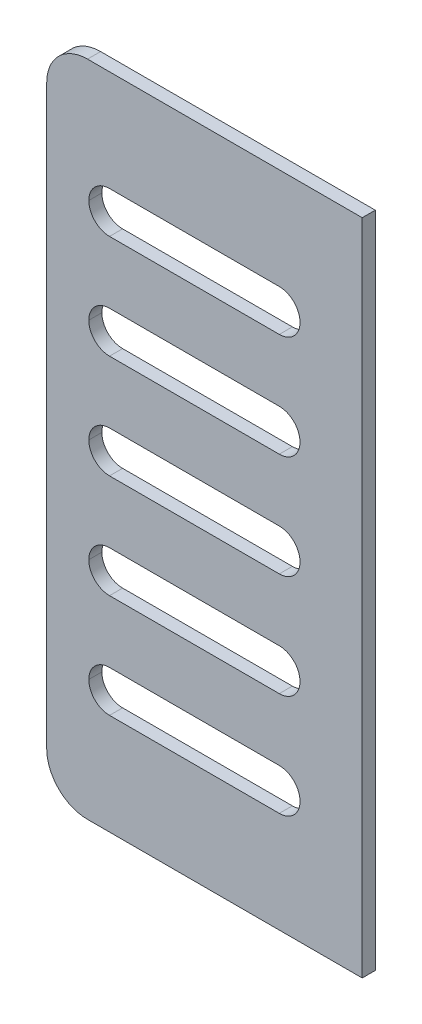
ISO-10303-21;
HEADER;
FILE_DESCRIPTION(('STEP AP214'),'2;1');
FILE_NAME('part.step','',(''),(''),'','','');
FILE_SCHEMA(('AUTOMOTIVE_DESIGN { 1 0 10303 214 1 1 1 1 }'));
ENDSEC;
DATA;
#1=APPLICATION_CONTEXT('core data for automotive mechanical design processes');
#2=APPLICATION_PROTOCOL_DEFINITION('international standard','automotive_design',2000,#1);
#3=PRODUCT_CONTEXT('',#1,'mechanical');
#4=PRODUCT('Part','Part','',(#3));
#5=PRODUCT_RELATED_PRODUCT_CATEGORY('part','',(#4));
#6=PRODUCT_DEFINITION_FORMATION('','',#4);
#7=PRODUCT_DEFINITION_CONTEXT('part definition',#1,'design');
#8=PRODUCT_DEFINITION('design','',#6,#7);
#9=PRODUCT_DEFINITION_SHAPE('','',#8);
#10=(LENGTH_UNIT() NAMED_UNIT(*) SI_UNIT(.MILLI.,.METRE.));
#11=(NAMED_UNIT(*) PLANE_ANGLE_UNIT() SI_UNIT($,.RADIAN.));
#12=(NAMED_UNIT(*) SI_UNIT($,.STERADIAN.) SOLID_ANGLE_UNIT());
#13=UNCERTAINTY_MEASURE_WITH_UNIT(LENGTH_MEASURE(1.E-05),#10,'distance_accuracy_value','');
#14=(GEOMETRIC_REPRESENTATION_CONTEXT(3) GLOBAL_UNCERTAINTY_ASSIGNED_CONTEXT((#13)) GLOBAL_UNIT_ASSIGNED_CONTEXT((#10,
#11,#12)) REPRESENTATION_CONTEXT('',''));
#15=CARTESIAN_POINT('',(0.,0.,0.));
#16=DIRECTION('',(0.,0.,1.));
#17=DIRECTION('',(1.,0.,0.));
#18=AXIS2_PLACEMENT_3D('',#15,#16,#17);
#19=CARTESIAN_POINT('',(0.,0.,16.));
#20=DIRECTION('',(0.,0.,-1.));
#21=DIRECTION('',(-1.,0.,0.));
#22=AXIS2_PLACEMENT_3D('',#19,#20,#21);
#23=PLANE('',#22);
#24=CARTESIAN_POINT('',(-230.14144673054,138.274365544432,16.));
#25=DIRECTION('',(0.,0.,-1.));
#26=DIRECTION('',(-1.,0.,0.));
#27=AXIS2_PLACEMENT_3D('',#24,#25,#26);
#28=CIRCLE('',#27,25.4);
#29=CARTESIAN_POINT('',(-230.14144673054,163.674365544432,16.));
#30=VERTEX_POINT('',#29);
#31=CARTESIAN_POINT('',(-204.74144673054,138.274365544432,16.));
#32=VERTEX_POINT('',#31);
#33=EDGE_CURVE('E397',#30,#32,#28,.T.);
#34=ORIENTED_EDGE('',*,*,#33,.T.);
#35=CARTESIAN_POINT('',(-230.14144673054,138.274365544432,16.));
#36=DIRECTION('',(0.,0.,-1.));
#37=DIRECTION('',(-1.,0.,0.));
#38=AXIS2_PLACEMENT_3D('',#35,#36,#37);
#39=CIRCLE('',#38,25.4);
#40=CARTESIAN_POINT('',(-230.14144673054,112.874365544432,16.));
#41=VERTEX_POINT('',#40);
#42=EDGE_CURVE('E417',#32,#41,#39,.T.);
#43=ORIENTED_EDGE('',*,*,#42,.T.);
#44=DIRECTION('',(1.,0.,0.));
#45=VECTOR('',#44,1.);
#46=CARTESIAN_POINT('',(-204.74144673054,112.874365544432,16.));
#47=LINE('',#46,#45);
#48=CARTESIAN_POINT('',(-438.041446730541,112.874365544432,16.));
#49=VERTEX_POINT('',#48);
#50=EDGE_CURVE('E519',#49,#41,#47,.T.);
#51=ORIENTED_EDGE('',*,*,#50,.F.);
#52=CARTESIAN_POINT('',(-438.041446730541,138.274365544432,16.));
#53=DIRECTION('',(0.,0.,-1.));
#54=DIRECTION('',(-1.,0.,0.));
#55=AXIS2_PLACEMENT_3D('',#52,#53,#54);
#56=CIRCLE('',#55,25.4);
#57=CARTESIAN_POINT('',(-463.441446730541,138.274365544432,16.));
#58=VERTEX_POINT('',#57);
#59=EDGE_CURVE('E377',#49,#58,#56,.T.);
#60=ORIENTED_EDGE('',*,*,#59,.T.);
#61=CARTESIAN_POINT('',(-438.041446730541,138.274365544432,16.));
#62=DIRECTION('',(0.,0.,-1.));
#63=DIRECTION('',(-1.,0.,0.));
#64=AXIS2_PLACEMENT_3D('',#61,#62,#63);
#65=CIRCLE('',#64,25.4);
#66=CARTESIAN_POINT('',(-438.041446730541,163.674365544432,16.));
#67=VERTEX_POINT('',#66);
#68=EDGE_CURVE('E365',#58,#67,#65,.T.);
#69=ORIENTED_EDGE('',*,*,#68,.T.);
#70=DIRECTION('',(-1.,0.,0.));
#71=VECTOR('',#70,1.);
#72=CARTESIAN_POINT('',(-204.74144673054,163.674365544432,16.));
#73=LINE('',#72,#71);
#74=EDGE_CURVE('E527',#30,#67,#73,.T.);
#75=ORIENTED_EDGE('',*,*,#74,.F.);
#76=EDGE_LOOP('',(#34,#43,#51,#60,#69,#75));
#77=FACE_BOUND('',#76,.T.);
#78=CARTESIAN_POINT('',(-230.14144673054,-115.725634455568,16.));
#79=DIRECTION('',(0.,0.,-1.));
#80=DIRECTION('',(-1.,0.,0.));
#81=AXIS2_PLACEMENT_3D('',#78,#79,#80);
#82=CIRCLE('',#81,25.4);
#83=CARTESIAN_POINT('',(-230.14144673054,-90.3256344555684,16.));
#84=VERTEX_POINT('',#83);
#85=CARTESIAN_POINT('',(-204.74144673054,-115.725634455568,16.));
#86=VERTEX_POINT('',#85);
#87=EDGE_CURVE('E405',#84,#86,#82,.T.);
#88=ORIENTED_EDGE('',*,*,#87,.T.);
#89=CARTESIAN_POINT('',(-230.14144673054,-115.725634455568,16.));
#90=DIRECTION('',(0.,0.,-1.));
#91=DIRECTION('',(-1.,0.,0.));
#92=AXIS2_PLACEMENT_3D('',#89,#90,#91);
#93=CIRCLE('',#92,25.4);
#94=CARTESIAN_POINT('',(-230.14144673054,-141.125634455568,16.));
#95=VERTEX_POINT('',#94);
#96=EDGE_CURVE('E425',#86,#95,#93,.T.);
#97=ORIENTED_EDGE('',*,*,#96,.T.);
#98=DIRECTION('',(1.,0.,0.));
#99=VECTOR('',#98,1.);
#100=CARTESIAN_POINT('',(-204.741446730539,-141.125634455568,16.));
#101=LINE('',#100,#99);
#102=CARTESIAN_POINT('',(-438.04144673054,-141.125634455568,16.));
#103=VERTEX_POINT('',#102);
#104=EDGE_CURVE('E495',#103,#95,#101,.T.);
#105=ORIENTED_EDGE('',*,*,#104,.F.);
#106=CARTESIAN_POINT('',(-438.04144673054,-115.725634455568,16.));
#107=DIRECTION('',(0.,0.,-1.));
#108=DIRECTION('',(-1.,0.,0.));
#109=AXIS2_PLACEMENT_3D('',#106,#107,#108);
#110=CIRCLE('',#109,25.4);
#111=CARTESIAN_POINT('',(-463.44144673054,-115.725634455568,16.));
#112=VERTEX_POINT('',#111);
#113=EDGE_CURVE('E385',#103,#112,#110,.T.);
#114=ORIENTED_EDGE('',*,*,#113,.T.);
#115=CARTESIAN_POINT('',(-438.04144673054,-115.725634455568,16.));
#116=DIRECTION('',(0.,0.,-1.));
#117=DIRECTION('',(-1.,0.,0.));
#118=AXIS2_PLACEMENT_3D('',#115,#116,#117);
#119=CIRCLE('',#118,25.4);
#120=CARTESIAN_POINT('',(-438.04144673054,-90.3256344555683,16.));
#121=VERTEX_POINT('',#120);
#122=EDGE_CURVE('E357',#112,#121,#119,.T.);
#123=ORIENTED_EDGE('',*,*,#122,.T.);
#124=DIRECTION('',(-1.,0.,0.));
#125=VECTOR('',#124,1.);
#126=CARTESIAN_POINT('',(-204.74144673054,-90.3256344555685,16.));
#127=LINE('',#126,#125);
#128=EDGE_CURVE('E503',#84,#121,#127,.T.);
#129=ORIENTED_EDGE('',*,*,#128,.F.);
#130=EDGE_LOOP('',(#88,#97,#105,#114,#123,#129));
#131=FACE_BOUND('',#130,.T.);
#132=DIRECTION('',(-1.,0.,0.));
#133=VECTOR('',#132,1.);
#134=CARTESIAN_POINT('',(-514.981446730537,414.474365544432,16.));
#135=LINE('',#134,#133);
#136=CARTESIAN_POINT('',(-128.541446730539,414.474365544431,16.));
#137=VERTEX_POINT('',#136);
#138=CARTESIAN_POINT('',(-464.981446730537,414.474365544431,16.));
#139=VERTEX_POINT('',#138);
#140=EDGE_CURVE('E300',#137,#139,#135,.T.);
#141=ORIENTED_EDGE('',*,*,#140,.T.);
#142=CARTESIAN_POINT('',(-464.981446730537,364.474365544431,16.));
#143=DIRECTION('',(0.,0.,-1.));
#144=DIRECTION('',(-1.,0.,0.));
#145=AXIS2_PLACEMENT_3D('',#142,#143,#144);
#146=CIRCLE('',#145,50.);
#147=CARTESIAN_POINT('',(-514.981446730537,364.474365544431,16.));
#148=VERTEX_POINT('',#147);
#149=EDGE_CURVE('E41',#139,#148,#146,.F.);
#150=ORIENTED_EDGE('',*,*,#149,.T.);
#151=DIRECTION('',(0.,-1.,0.));
#152=VECTOR('',#151,1.);
#153=CARTESIAN_POINT('',(-514.981446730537,414.474365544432,16.));
#154=LINE('',#153,#152);
#155=CARTESIAN_POINT('',(-514.981446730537,-341.925634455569,16.));
#156=VERTEX_POINT('',#155);
#157=EDGE_CURVE('E274',#148,#156,#154,.T.);
#158=ORIENTED_EDGE('',*,*,#157,.T.);
#159=CARTESIAN_POINT('',(-464.981446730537,-341.925634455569,16.));
#160=DIRECTION('',(0.,0.,-1.));
#161=DIRECTION('',(-1.,0.,0.));
#162=AXIS2_PLACEMENT_3D('',#159,#160,#161);
#163=CIRCLE('',#162,50.);
#164=CARTESIAN_POINT('',(-464.981446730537,-391.925634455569,16.));
#165=VERTEX_POINT('',#164);
#166=EDGE_CURVE('E48',#156,#165,#163,.F.);
#167=ORIENTED_EDGE('',*,*,#166,.T.);
#168=DIRECTION('',(1.,0.,0.));
#169=VECTOR('',#168,1.);
#170=CARTESIAN_POINT('',(-514.981446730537,-391.925634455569,16.));
#171=LINE('',#170,#169);
#172=CARTESIAN_POINT('',(-128.541446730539,-391.925634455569,16.));
#173=VERTEX_POINT('',#172);
#174=EDGE_CURVE('E266',#165,#173,#171,.T.);
#175=ORIENTED_EDGE('',*,*,#174,.T.);
#176=DIRECTION('',(0.,1.,0.));
#177=VECTOR('',#176,1.);
#178=CARTESIAN_POINT('',(-128.541446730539,414.474365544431,16.));
#179=LINE('',#178,#177);
#180=EDGE_CURVE('E270',#173,#137,#179,.T.);
#181=ORIENTED_EDGE('',*,*,#180,.T.);
#182=EDGE_LOOP('',(#141,#150,#158,#167,#175,#181));
#183=FACE_BOUND('',#182,.T.);
#184=CARTESIAN_POINT('',(-230.141446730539,-242.725634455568,16.));
#185=DIRECTION('',(0.,0.,-1.));
#186=DIRECTION('',(-1.,0.,0.));
#187=AXIS2_PLACEMENT_3D('',#184,#185,#186);
#188=CIRCLE('',#187,25.4);
#189=CARTESIAN_POINT('',(-230.141446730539,-217.325634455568,16.));
#190=VERTEX_POINT('',#189);
#191=CARTESIAN_POINT('',(-204.741446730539,-242.725634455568,16.));
#192=VERTEX_POINT('',#191);
#193=EDGE_CURVE('E409',#190,#192,#188,.T.);
#194=ORIENTED_EDGE('',*,*,#193,.T.);
#195=CARTESIAN_POINT('',(-230.141446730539,-242.725634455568,16.));
#196=DIRECTION('',(0.,0.,-1.));
#197=DIRECTION('',(-1.,0.,0.));
#198=AXIS2_PLACEMENT_3D('',#195,#196,#197);
#199=CIRCLE('',#198,25.4);
#200=CARTESIAN_POINT('',(-230.141446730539,-268.125634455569,16.));
#201=VERTEX_POINT('',#200);
#202=EDGE_CURVE('E429',#192,#201,#199,.T.);
#203=ORIENTED_EDGE('',*,*,#202,.T.);
#204=DIRECTION('',(1.,0.,0.));
#205=VECTOR('',#204,1.);
#206=CARTESIAN_POINT('',(-204.741446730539,-268.125634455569,16.));
#207=LINE('',#206,#205);
#208=CARTESIAN_POINT('',(-438.04144673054,-268.125634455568,16.));
#209=VERTEX_POINT('',#208);
#210=EDGE_CURVE('E295',#209,#201,#207,.T.);
#211=ORIENTED_EDGE('',*,*,#210,.F.);
#212=CARTESIAN_POINT('',(-438.04144673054,-242.725634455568,16.));
#213=DIRECTION('',(0.,0.,-1.));
#214=DIRECTION('',(-1.,0.,0.));
#215=AXIS2_PLACEMENT_3D('',#212,#213,#214);
#216=CIRCLE('',#215,25.4);
#217=CARTESIAN_POINT('',(-463.44144673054,-242.725634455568,16.));
#218=VERTEX_POINT('',#217);
#219=EDGE_CURVE('E389',#209,#218,#216,.T.);
#220=ORIENTED_EDGE('',*,*,#219,.T.);
#221=CARTESIAN_POINT('',(-438.04144673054,-242.725634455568,16.));
#222=DIRECTION('',(0.,0.,-1.));
#223=DIRECTION('',(-1.,0.,0.));
#224=AXIS2_PLACEMENT_3D('',#221,#222,#223);
#225=CIRCLE('',#224,25.4);
#226=CARTESIAN_POINT('',(-438.04144673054,-217.325634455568,16.));
#227=VERTEX_POINT('',#226);
#228=EDGE_CURVE('E353',#218,#227,#225,.T.);
#229=ORIENTED_EDGE('',*,*,#228,.T.);
#230=DIRECTION('',(-1.,0.,0.));
#231=VECTOR('',#230,1.);
#232=CARTESIAN_POINT('',(-204.741446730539,-217.325634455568,16.));
#233=LINE('',#232,#231);
#234=EDGE_CURVE('E491',#190,#227,#233,.T.);
#235=ORIENTED_EDGE('',*,*,#234,.F.);
#236=EDGE_LOOP('',(#194,#203,#211,#220,#229,#235));
#237=FACE_BOUND('',#236,.T.);
#238=CARTESIAN_POINT('',(-230.14144673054,11.2743655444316,16.));
#239=DIRECTION('',(0.,0.,-1.));
#240=DIRECTION('',(-1.,0.,0.));
#241=AXIS2_PLACEMENT_3D('',#238,#239,#240);
#242=CIRCLE('',#241,25.4);
#243=CARTESIAN_POINT('',(-230.14144673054,36.6743655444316,16.));
#244=VERTEX_POINT('',#243);
#245=CARTESIAN_POINT('',(-204.74144673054,11.2743655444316,16.));
#246=VERTEX_POINT('',#245);
#247=EDGE_CURVE('E401',#244,#246,#242,.T.);
#248=ORIENTED_EDGE('',*,*,#247,.T.);
#249=CARTESIAN_POINT('',(-230.14144673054,11.2743655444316,16.));
#250=DIRECTION('',(0.,0.,-1.));
#251=DIRECTION('',(-1.,0.,0.));
#252=AXIS2_PLACEMENT_3D('',#249,#250,#251);
#253=CIRCLE('',#252,25.4);
#254=CARTESIAN_POINT('',(-230.14144673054,-14.1256344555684,16.));
#255=VERTEX_POINT('',#254);
#256=EDGE_CURVE('E421',#246,#255,#253,.T.);
#257=ORIENTED_EDGE('',*,*,#256,.T.);
#258=DIRECTION('',(1.,0.,0.));
#259=VECTOR('',#258,1.);
#260=CARTESIAN_POINT('',(-204.74144673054,-14.1256344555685,16.));
#261=LINE('',#260,#259);
#262=CARTESIAN_POINT('',(-438.041446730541,-14.1256344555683,16.));
#263=VERTEX_POINT('',#262);
#264=EDGE_CURVE('E507',#263,#255,#261,.T.);
#265=ORIENTED_EDGE('',*,*,#264,.F.);
#266=CARTESIAN_POINT('',(-438.041446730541,11.2743655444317,16.));
#267=DIRECTION('',(0.,0.,-1.));
#268=DIRECTION('',(-1.,0.,0.));
#269=AXIS2_PLACEMENT_3D('',#266,#267,#268);
#270=CIRCLE('',#269,25.4);
#271=CARTESIAN_POINT('',(-463.441446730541,11.2743655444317,16.));
#272=VERTEX_POINT('',#271);
#273=EDGE_CURVE('E381',#263,#272,#270,.T.);
#274=ORIENTED_EDGE('',*,*,#273,.T.);
#275=CARTESIAN_POINT('',(-438.041446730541,11.2743655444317,16.));
#276=DIRECTION('',(0.,0.,-1.));
#277=DIRECTION('',(-1.,0.,0.));
#278=AXIS2_PLACEMENT_3D('',#275,#276,#277);
#279=CIRCLE('',#278,25.4);
#280=CARTESIAN_POINT('',(-438.041446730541,36.6743655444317,16.));
#281=VERTEX_POINT('',#280);
#282=EDGE_CURVE('E361',#272,#281,#279,.T.);
#283=ORIENTED_EDGE('',*,*,#282,.T.);
#284=DIRECTION('',(-1.,0.,0.));
#285=VECTOR('',#284,1.);
#286=CARTESIAN_POINT('',(-204.74144673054,36.6743655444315,16.));
#287=LINE('',#286,#285);
#288=EDGE_CURVE('E515',#244,#281,#287,.T.);
#289=ORIENTED_EDGE('',*,*,#288,.F.);
#290=EDGE_LOOP('',(#248,#257,#265,#274,#283,#289));
#291=FACE_BOUND('',#290,.T.);
#292=CARTESIAN_POINT('',(-230.141446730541,265.274365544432,16.));
#293=DIRECTION('',(0.,0.,-1.));
#294=DIRECTION('',(-1.,0.,0.));
#295=AXIS2_PLACEMENT_3D('',#292,#293,#294);
#296=CIRCLE('',#295,25.4);
#297=CARTESIAN_POINT('',(-230.141446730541,290.674365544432,16.));
#298=VERTEX_POINT('',#297);
#299=CARTESIAN_POINT('',(-204.741446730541,265.274365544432,16.));
#300=VERTEX_POINT('',#299);
#301=EDGE_CURVE('E393',#298,#300,#296,.T.);
#302=ORIENTED_EDGE('',*,*,#301,.T.);
#303=CARTESIAN_POINT('',(-230.141446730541,265.274365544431,16.));
#304=DIRECTION('',(0.,0.,-1.));
#305=DIRECTION('',(-1.,0.,0.));
#306=AXIS2_PLACEMENT_3D('',#303,#304,#305);
#307=CIRCLE('',#306,25.4);
#308=CARTESIAN_POINT('',(-230.141446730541,239.874365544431,16.));
#309=VERTEX_POINT('',#308);
#310=EDGE_CURVE('E413',#300,#309,#307,.T.);
#311=ORIENTED_EDGE('',*,*,#310,.T.);
#312=DIRECTION('',(1.,0.,0.));
#313=VECTOR('',#312,1.);
#314=CARTESIAN_POINT('',(-204.741446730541,239.874365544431,16.));
#315=LINE('',#314,#313);
#316=CARTESIAN_POINT('',(-438.041446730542,239.874365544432,16.));
#317=VERTEX_POINT('',#316);
#318=EDGE_CURVE('E531',#317,#309,#315,.T.);
#319=ORIENTED_EDGE('',*,*,#318,.F.);
#320=CARTESIAN_POINT('',(-438.041446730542,265.274365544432,16.));
#321=DIRECTION('',(0.,0.,-1.));
#322=DIRECTION('',(-1.,0.,0.));
#323=AXIS2_PLACEMENT_3D('',#320,#321,#322);
#324=CIRCLE('',#323,25.4);
#325=CARTESIAN_POINT('',(-463.441446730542,265.274365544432,16.));
#326=VERTEX_POINT('',#325);
#327=EDGE_CURVE('E373',#317,#326,#324,.T.);
#328=ORIENTED_EDGE('',*,*,#327,.T.);
#329=CARTESIAN_POINT('',(-438.041446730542,265.274365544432,16.));
#330=DIRECTION('',(0.,0.,-1.));
#331=DIRECTION('',(-1.,0.,0.));
#332=AXIS2_PLACEMENT_3D('',#329,#330,#331);
#333=CIRCLE('',#332,25.4);
#334=CARTESIAN_POINT('',(-438.041446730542,290.674365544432,16.));
#335=VERTEX_POINT('',#334);
#336=EDGE_CURVE('E369',#326,#335,#333,.T.);
#337=ORIENTED_EDGE('',*,*,#336,.T.);
#338=DIRECTION('',(-1.,0.,0.));
#339=VECTOR('',#338,1.);
#340=CARTESIAN_POINT('',(-204.741446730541,290.674365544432,16.));
#341=LINE('',#340,#339);
#342=EDGE_CURVE('E539',#298,#335,#341,.T.);
#343=ORIENTED_EDGE('',*,*,#342,.F.);
#344=EDGE_LOOP('',(#302,#311,#319,#328,#337,#343));
#345=FACE_BOUND('',#344,.T.);
#346=ADVANCED_FACE('F33',(#77,#131,#183,#237,#291,#345),#23,.F.);
#347=CARTESIAN_POINT('',(0.,0.,0.));
#348=DIRECTION('',(0.,0.,-1.));
#349=DIRECTION('',(-1.,0.,0.));
#350=AXIS2_PLACEMENT_3D('',#347,#348,#349);
#351=PLANE('',#350);
#352=DIRECTION('',(0.,-1.,0.));
#353=VECTOR('',#352,1.);
#354=CARTESIAN_POINT('',(-514.981446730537,414.474365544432,0.));
#355=LINE('',#354,#353);
#356=CARTESIAN_POINT('',(-514.981446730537,364.474365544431,0.));
#357=VERTEX_POINT('',#356);
#358=CARTESIAN_POINT('',(-514.981446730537,-341.925634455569,0.));
#359=VERTEX_POINT('',#358);
#360=EDGE_CURVE('E294',#357,#359,#355,.T.);
#361=ORIENTED_EDGE('',*,*,#360,.F.);
#362=CARTESIAN_POINT('',(-464.981446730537,364.474365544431,0.));
#363=DIRECTION('',(0.,0.,-1.));
#364=DIRECTION('',(-1.,0.,0.));
#365=AXIS2_PLACEMENT_3D('',#362,#363,#364);
#366=CIRCLE('',#365,50.);
#367=CARTESIAN_POINT('',(-464.981446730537,414.474365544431,0.));
#368=VERTEX_POINT('',#367);
#369=EDGE_CURVE('E469',#357,#368,#366,.T.);
#370=ORIENTED_EDGE('',*,*,#369,.T.);
#371=DIRECTION('',(-1.,0.,0.));
#372=VECTOR('',#371,1.);
#373=CARTESIAN_POINT('',(-514.981446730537,414.474365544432,0.));
#374=LINE('',#373,#372);
#375=CARTESIAN_POINT('',(-128.541446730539,414.474365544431,0.));
#376=VERTEX_POINT('',#375);
#377=EDGE_CURVE('E292',#376,#368,#374,.T.);
#378=ORIENTED_EDGE('',*,*,#377,.F.);
#379=DIRECTION('',(0.,1.,0.));
#380=VECTOR('',#379,1.);
#381=CARTESIAN_POINT('',(-128.541446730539,414.474365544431,0.));
#382=LINE('',#381,#380);
#383=CARTESIAN_POINT('',(-128.541446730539,-391.925634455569,0.));
#384=VERTEX_POINT('',#383);
#385=EDGE_CURVE('E299',#384,#376,#382,.T.);
#386=ORIENTED_EDGE('',*,*,#385,.F.);
#387=DIRECTION('',(1.,0.,0.));
#388=VECTOR('',#387,1.);
#389=CARTESIAN_POINT('',(-514.981446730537,-391.925634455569,0.));
#390=LINE('',#389,#388);
#391=CARTESIAN_POINT('',(-464.981446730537,-391.925634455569,0.));
#392=VERTEX_POINT('',#391);
#393=EDGE_CURVE('E280',#392,#384,#390,.T.);
#394=ORIENTED_EDGE('',*,*,#393,.F.);
#395=CARTESIAN_POINT('',(-464.981446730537,-341.925634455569,0.));
#396=DIRECTION('',(0.,0.,-1.));
#397=DIRECTION('',(-1.,0.,0.));
#398=AXIS2_PLACEMENT_3D('',#395,#396,#397);
#399=CIRCLE('',#398,50.);
#400=EDGE_CURVE('E467',#392,#359,#399,.T.);
#401=ORIENTED_EDGE('',*,*,#400,.T.);
#402=EDGE_LOOP('',(#361,#370,#378,#386,#394,#401));
#403=FACE_BOUND('',#402,.T.);
#404=CARTESIAN_POINT('',(-438.04144673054,-242.725634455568,0.));
#405=DIRECTION('',(0.,0.,-1.));
#406=DIRECTION('',(-1.,0.,0.));
#407=AXIS2_PLACEMENT_3D('',#404,#405,#406);
#408=CIRCLE('',#407,25.4);
#409=CARTESIAN_POINT('',(-438.04144673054,-217.325634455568,0.));
#410=VERTEX_POINT('',#409);
#411=CARTESIAN_POINT('',(-463.44144673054,-242.725634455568,0.));
#412=VERTEX_POINT('',#411);
#413=EDGE_CURVE('E351',#410,#412,#408,.F.);
#414=ORIENTED_EDGE('',*,*,#413,.T.);
#415=CARTESIAN_POINT('',(-438.04144673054,-242.725634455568,0.));
#416=DIRECTION('',(0.,0.,-1.));
#417=DIRECTION('',(-1.,0.,0.));
#418=AXIS2_PLACEMENT_3D('',#415,#416,#417);
#419=CIRCLE('',#418,25.4);
#420=CARTESIAN_POINT('',(-438.04144673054,-268.125634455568,0.));
#421=VERTEX_POINT('',#420);
#422=EDGE_CURVE('E387',#412,#421,#419,.F.);
#423=ORIENTED_EDGE('',*,*,#422,.T.);
#424=DIRECTION('',(1.,0.,0.));
#425=VECTOR('',#424,1.);
#426=CARTESIAN_POINT('',(-204.741446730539,-268.125634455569,0.));
#427=LINE('',#426,#425);
#428=CARTESIAN_POINT('',(-230.141446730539,-268.125634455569,0.));
#429=VERTEX_POINT('',#428);
#430=EDGE_CURVE('E488',#421,#429,#427,.T.);
#431=ORIENTED_EDGE('',*,*,#430,.T.);
#432=CARTESIAN_POINT('',(-230.141446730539,-242.725634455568,0.));
#433=DIRECTION('',(0.,0.,-1.));
#434=DIRECTION('',(-1.,0.,0.));
#435=AXIS2_PLACEMENT_3D('',#432,#433,#434);
#436=CIRCLE('',#435,25.4);
#437=CARTESIAN_POINT('',(-204.741446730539,-242.725634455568,0.));
#438=VERTEX_POINT('',#437);
#439=EDGE_CURVE('E427',#429,#438,#436,.F.);
#440=ORIENTED_EDGE('',*,*,#439,.T.);
#441=CARTESIAN_POINT('',(-230.141446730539,-242.725634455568,0.));
#442=DIRECTION('',(0.,0.,-1.));
#443=DIRECTION('',(-1.,0.,0.));
#444=AXIS2_PLACEMENT_3D('',#441,#442,#443);
#445=CIRCLE('',#444,25.4);
#446=CARTESIAN_POINT('',(-230.141446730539,-217.325634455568,0.));
#447=VERTEX_POINT('',#446);
#448=EDGE_CURVE('E407',#438,#447,#445,.F.);
#449=ORIENTED_EDGE('',*,*,#448,.T.);
#450=DIRECTION('',(-1.,0.,0.));
#451=VECTOR('',#450,1.);
#452=CARTESIAN_POINT('',(-204.741446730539,-217.325634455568,0.));
#453=LINE('',#452,#451);
#454=EDGE_CURVE('E492',#447,#410,#453,.T.);
#455=ORIENTED_EDGE('',*,*,#454,.T.);
#456=EDGE_LOOP('',(#414,#423,#431,#440,#449,#455));
#457=FACE_BOUND('',#456,.T.);
#458=CARTESIAN_POINT('',(-438.04144673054,-115.725634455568,0.));
#459=DIRECTION('',(0.,0.,-1.));
#460=DIRECTION('',(-1.,0.,0.));
#461=AXIS2_PLACEMENT_3D('',#458,#459,#460);
#462=CIRCLE('',#461,25.4);
#463=CARTESIAN_POINT('',(-438.04144673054,-90.3256344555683,0.));
#464=VERTEX_POINT('',#463);
#465=CARTESIAN_POINT('',(-463.44144673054,-115.725634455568,0.));
#466=VERTEX_POINT('',#465);
#467=EDGE_CURVE('E355',#464,#466,#462,.F.);
#468=ORIENTED_EDGE('',*,*,#467,.T.);
#469=CARTESIAN_POINT('',(-438.04144673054,-115.725634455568,0.));
#470=DIRECTION('',(0.,0.,-1.));
#471=DIRECTION('',(-1.,0.,0.));
#472=AXIS2_PLACEMENT_3D('',#469,#470,#471);
#473=CIRCLE('',#472,25.4);
#474=CARTESIAN_POINT('',(-438.04144673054,-141.125634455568,0.));
#475=VERTEX_POINT('',#474);
#476=EDGE_CURVE('E383',#466,#475,#473,.F.);
#477=ORIENTED_EDGE('',*,*,#476,.T.);
#478=DIRECTION('',(1.,0.,0.));
#479=VECTOR('',#478,1.);
#480=CARTESIAN_POINT('',(-204.741446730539,-141.125634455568,0.));
#481=LINE('',#480,#479);
#482=CARTESIAN_POINT('',(-230.14144673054,-141.125634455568,0.));
#483=VERTEX_POINT('',#482);
#484=EDGE_CURVE('E500',#475,#483,#481,.T.);
#485=ORIENTED_EDGE('',*,*,#484,.T.);
#486=CARTESIAN_POINT('',(-230.14144673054,-115.725634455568,0.));
#487=DIRECTION('',(0.,0.,-1.));
#488=DIRECTION('',(-1.,0.,0.));
#489=AXIS2_PLACEMENT_3D('',#486,#487,#488);
#490=CIRCLE('',#489,25.4);
#491=CARTESIAN_POINT('',(-204.74144673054,-115.725634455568,0.));
#492=VERTEX_POINT('',#491);
#493=EDGE_CURVE('E423',#483,#492,#490,.F.);
#494=ORIENTED_EDGE('',*,*,#493,.T.);
#495=CARTESIAN_POINT('',(-230.14144673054,-115.725634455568,0.));
#496=DIRECTION('',(0.,0.,-1.));
#497=DIRECTION('',(-1.,0.,0.));
#498=AXIS2_PLACEMENT_3D('',#495,#496,#497);
#499=CIRCLE('',#498,25.4);
#500=CARTESIAN_POINT('',(-230.14144673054,-90.3256344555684,0.));
#501=VERTEX_POINT('',#500);
#502=EDGE_CURVE('E403',#492,#501,#499,.F.);
#503=ORIENTED_EDGE('',*,*,#502,.T.);
#504=DIRECTION('',(-1.,0.,0.));
#505=VECTOR('',#504,1.);
#506=CARTESIAN_POINT('',(-204.74144673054,-90.3256344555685,0.));
#507=LINE('',#506,#505);
#508=EDGE_CURVE('E504',#501,#464,#507,.T.);
#509=ORIENTED_EDGE('',*,*,#508,.T.);
#510=EDGE_LOOP('',(#468,#477,#485,#494,#503,#509));
#511=FACE_BOUND('',#510,.T.);
#512=CARTESIAN_POINT('',(-438.041446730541,11.2743655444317,0.));
#513=DIRECTION('',(0.,0.,-1.));
#514=DIRECTION('',(-1.,0.,0.));
#515=AXIS2_PLACEMENT_3D('',#512,#513,#514);
#516=CIRCLE('',#515,25.4);
#517=CARTESIAN_POINT('',(-438.041446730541,36.6743655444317,0.));
#518=VERTEX_POINT('',#517);
#519=CARTESIAN_POINT('',(-463.441446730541,11.2743655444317,0.));
#520=VERTEX_POINT('',#519);
#521=EDGE_CURVE('E359',#518,#520,#516,.F.);
#522=ORIENTED_EDGE('',*,*,#521,.T.);
#523=CARTESIAN_POINT('',(-438.041446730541,11.2743655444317,0.));
#524=DIRECTION('',(0.,0.,-1.));
#525=DIRECTION('',(-1.,0.,0.));
#526=AXIS2_PLACEMENT_3D('',#523,#524,#525);
#527=CIRCLE('',#526,25.4);
#528=CARTESIAN_POINT('',(-438.041446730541,-14.1256344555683,0.));
#529=VERTEX_POINT('',#528);
#530=EDGE_CURVE('E379',#520,#529,#527,.F.);
#531=ORIENTED_EDGE('',*,*,#530,.T.);
#532=DIRECTION('',(1.,0.,0.));
#533=VECTOR('',#532,1.);
#534=CARTESIAN_POINT('',(-204.74144673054,-14.1256344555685,0.));
#535=LINE('',#534,#533);
#536=CARTESIAN_POINT('',(-230.14144673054,-14.1256344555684,0.));
#537=VERTEX_POINT('',#536);
#538=EDGE_CURVE('E512',#529,#537,#535,.T.);
#539=ORIENTED_EDGE('',*,*,#538,.T.);
#540=CARTESIAN_POINT('',(-230.14144673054,11.2743655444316,0.));
#541=DIRECTION('',(0.,0.,-1.));
#542=DIRECTION('',(-1.,0.,0.));
#543=AXIS2_PLACEMENT_3D('',#540,#541,#542);
#544=CIRCLE('',#543,25.4);
#545=CARTESIAN_POINT('',(-204.74144673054,11.2743655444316,0.));
#546=VERTEX_POINT('',#545);
#547=EDGE_CURVE('E419',#537,#546,#544,.F.);
#548=ORIENTED_EDGE('',*,*,#547,.T.);
#549=CARTESIAN_POINT('',(-230.14144673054,11.2743655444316,0.));
#550=DIRECTION('',(0.,0.,-1.));
#551=DIRECTION('',(-1.,0.,0.));
#552=AXIS2_PLACEMENT_3D('',#549,#550,#551);
#553=CIRCLE('',#552,25.4);
#554=CARTESIAN_POINT('',(-230.14144673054,36.6743655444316,0.));
#555=VERTEX_POINT('',#554);
#556=EDGE_CURVE('E399',#546,#555,#553,.F.);
#557=ORIENTED_EDGE('',*,*,#556,.T.);
#558=DIRECTION('',(-1.,0.,0.));
#559=VECTOR('',#558,1.);
#560=CARTESIAN_POINT('',(-204.74144673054,36.6743655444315,0.));
#561=LINE('',#560,#559);
#562=EDGE_CURVE('E516',#555,#518,#561,.T.);
#563=ORIENTED_EDGE('',*,*,#562,.T.);
#564=EDGE_LOOP('',(#522,#531,#539,#548,#557,#563));
#565=FACE_BOUND('',#564,.T.);
#566=CARTESIAN_POINT('',(-438.041446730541,138.274365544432,0.));
#567=DIRECTION('',(0.,0.,-1.));
#568=DIRECTION('',(-1.,0.,0.));
#569=AXIS2_PLACEMENT_3D('',#566,#567,#568);
#570=CIRCLE('',#569,25.4);
#571=CARTESIAN_POINT('',(-438.041446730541,163.674365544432,0.));
#572=VERTEX_POINT('',#571);
#573=CARTESIAN_POINT('',(-463.441446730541,138.274365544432,0.));
#574=VERTEX_POINT('',#573);
#575=EDGE_CURVE('E363',#572,#574,#570,.F.);
#576=ORIENTED_EDGE('',*,*,#575,.T.);
#577=CARTESIAN_POINT('',(-438.041446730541,138.274365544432,0.));
#578=DIRECTION('',(0.,0.,-1.));
#579=DIRECTION('',(-1.,0.,0.));
#580=AXIS2_PLACEMENT_3D('',#577,#578,#579);
#581=CIRCLE('',#580,25.4);
#582=CARTESIAN_POINT('',(-438.041446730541,112.874365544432,0.));
#583=VERTEX_POINT('',#582);
#584=EDGE_CURVE('E375',#574,#583,#581,.F.);
#585=ORIENTED_EDGE('',*,*,#584,.T.);
#586=DIRECTION('',(1.,0.,0.));
#587=VECTOR('',#586,1.);
#588=CARTESIAN_POINT('',(-204.74144673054,112.874365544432,0.));
#589=LINE('',#588,#587);
#590=CARTESIAN_POINT('',(-230.14144673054,112.874365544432,0.));
#591=VERTEX_POINT('',#590);
#592=EDGE_CURVE('E524',#583,#591,#589,.T.);
#593=ORIENTED_EDGE('',*,*,#592,.T.);
#594=CARTESIAN_POINT('',(-230.14144673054,138.274365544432,0.));
#595=DIRECTION('',(0.,0.,-1.));
#596=DIRECTION('',(-1.,0.,0.));
#597=AXIS2_PLACEMENT_3D('',#594,#595,#596);
#598=CIRCLE('',#597,25.4);
#599=CARTESIAN_POINT('',(-204.74144673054,138.274365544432,0.));
#600=VERTEX_POINT('',#599);
#601=EDGE_CURVE('E415',#591,#600,#598,.F.);
#602=ORIENTED_EDGE('',*,*,#601,.T.);
#603=CARTESIAN_POINT('',(-230.14144673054,138.274365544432,0.));
#604=DIRECTION('',(0.,0.,-1.));
#605=DIRECTION('',(-1.,0.,0.));
#606=AXIS2_PLACEMENT_3D('',#603,#604,#605);
#607=CIRCLE('',#606,25.4);
#608=CARTESIAN_POINT('',(-230.14144673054,163.674365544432,0.));
#609=VERTEX_POINT('',#608);
#610=EDGE_CURVE('E395',#600,#609,#607,.F.);
#611=ORIENTED_EDGE('',*,*,#610,.T.);
#612=DIRECTION('',(-1.,0.,0.));
#613=VECTOR('',#612,1.);
#614=CARTESIAN_POINT('',(-204.74144673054,163.674365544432,0.));
#615=LINE('',#614,#613);
#616=EDGE_CURVE('E528',#609,#572,#615,.T.);
#617=ORIENTED_EDGE('',*,*,#616,.T.);
#618=EDGE_LOOP('',(#576,#585,#593,#602,#611,#617));
#619=FACE_BOUND('',#618,.T.);
#620=CARTESIAN_POINT('',(-438.041446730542,265.274365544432,0.));
#621=DIRECTION('',(0.,0.,-1.));
#622=DIRECTION('',(-1.,0.,0.));
#623=AXIS2_PLACEMENT_3D('',#620,#621,#622);
#624=CIRCLE('',#623,25.4);
#625=CARTESIAN_POINT('',(-438.041446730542,290.674365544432,0.));
#626=VERTEX_POINT('',#625);
#627=CARTESIAN_POINT('',(-463.441446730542,265.274365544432,0.));
#628=VERTEX_POINT('',#627);
#629=EDGE_CURVE('E367',#626,#628,#624,.F.);
#630=ORIENTED_EDGE('',*,*,#629,.T.);
#631=CARTESIAN_POINT('',(-438.041446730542,265.274365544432,0.));
#632=DIRECTION('',(0.,0.,-1.));
#633=DIRECTION('',(-1.,0.,0.));
#634=AXIS2_PLACEMENT_3D('',#631,#632,#633);
#635=CIRCLE('',#634,25.4);
#636=CARTESIAN_POINT('',(-438.041446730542,239.874365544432,0.));
#637=VERTEX_POINT('',#636);
#638=EDGE_CURVE('E371',#628,#637,#635,.F.);
#639=ORIENTED_EDGE('',*,*,#638,.T.);
#640=DIRECTION('',(1.,0.,0.));
#641=VECTOR('',#640,1.);
#642=CARTESIAN_POINT('',(-204.741446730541,239.874365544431,0.));
#643=LINE('',#642,#641);
#644=CARTESIAN_POINT('',(-230.141446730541,239.874365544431,0.));
#645=VERTEX_POINT('',#644);
#646=EDGE_CURVE('E536',#637,#645,#643,.T.);
#647=ORIENTED_EDGE('',*,*,#646,.T.);
#648=CARTESIAN_POINT('',(-230.141446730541,265.274365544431,0.));
#649=DIRECTION('',(0.,0.,-1.));
#650=DIRECTION('',(-1.,0.,0.));
#651=AXIS2_PLACEMENT_3D('',#648,#649,#650);
#652=CIRCLE('',#651,25.4);
#653=CARTESIAN_POINT('',(-204.741446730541,265.274365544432,0.));
#654=VERTEX_POINT('',#653);
#655=EDGE_CURVE('E411',#645,#654,#652,.F.);
#656=ORIENTED_EDGE('',*,*,#655,.T.);
#657=CARTESIAN_POINT('',(-230.141446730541,265.274365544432,0.));
#658=DIRECTION('',(0.,0.,-1.));
#659=DIRECTION('',(-1.,0.,0.));
#660=AXIS2_PLACEMENT_3D('',#657,#658,#659);
#661=CIRCLE('',#660,25.4);
#662=CARTESIAN_POINT('',(-230.141446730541,290.674365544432,0.));
#663=VERTEX_POINT('',#662);
#664=EDGE_CURVE('E391',#654,#663,#661,.F.);
#665=ORIENTED_EDGE('',*,*,#664,.T.);
#666=DIRECTION('',(-1.,0.,0.));
#667=VECTOR('',#666,1.);
#668=CARTESIAN_POINT('',(-204.741446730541,290.674365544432,0.));
#669=LINE('',#668,#667);
#670=EDGE_CURVE('E435',#663,#626,#669,.T.);
#671=ORIENTED_EDGE('',*,*,#670,.T.);
#672=EDGE_LOOP('',(#630,#639,#647,#656,#665,#671));
#673=FACE_BOUND('',#672,.T.);
#674=ADVANCED_FACE('F483',(#403,#457,#511,#565,#619,#673),#351,.T.);
#675=CARTESIAN_POINT('',(-514.981446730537,414.474365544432,16.));
#676=DIRECTION('',(0.,-1.,0.));
#677=DIRECTION('',(1.,0.,0.));
#678=AXIS2_PLACEMENT_3D('',#675,#676,#677);
#679=PLANE('',#678);
#680=ORIENTED_EDGE('',*,*,#377,.T.);
#681=DIRECTION('',(0.,0.,-1.));
#682=VECTOR('',#681,1.);
#683=CARTESIAN_POINT('',(-464.981446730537,414.474365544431,16.));
#684=LINE('',#683,#682);
#685=EDGE_CURVE('E56',#368,#139,#684,.F.);
#686=ORIENTED_EDGE('',*,*,#685,.T.);
#687=ORIENTED_EDGE('',*,*,#140,.F.);
#688=DIRECTION('',(0.,0.,-1.));
#689=VECTOR('',#688,1.);
#690=CARTESIAN_POINT('',(-128.541446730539,414.474365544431,16.));
#691=LINE('',#690,#689);
#692=EDGE_CURVE('E284',#137,#376,#691,.T.);
#693=ORIENTED_EDGE('',*,*,#692,.T.);
#694=EDGE_LOOP('',(#680,#686,#687,#693));
#695=FACE_BOUND('',#694,.T.);
#696=ADVANCED_FACE('F485',(#695),#679,.F.);
#697=CARTESIAN_POINT('',(-514.981446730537,414.474365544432,16.));
#698=DIRECTION('',(1.,0.,0.));
#699=DIRECTION('',(0.,1.,0.));
#700=AXIS2_PLACEMENT_3D('',#697,#698,#699);
#701=PLANE('',#700);
#702=ORIENTED_EDGE('',*,*,#157,.F.);
#703=DIRECTION('',(0.,0.,-1.));
#704=VECTOR('',#703,1.);
#705=CARTESIAN_POINT('',(-514.981446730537,364.474365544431,16.));
#706=LINE('',#705,#704);
#707=EDGE_CURVE('E464',#148,#357,#706,.T.);
#708=ORIENTED_EDGE('',*,*,#707,.T.);
#709=ORIENTED_EDGE('',*,*,#360,.T.);
#710=DIRECTION('',(0.,0.,-1.));
#711=VECTOR('',#710,1.);
#712=CARTESIAN_POINT('',(-514.981446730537,-341.925634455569,16.));
#713=LINE('',#712,#711);
#714=EDGE_CURVE('E431',#359,#156,#713,.F.);
#715=ORIENTED_EDGE('',*,*,#714,.T.);
#716=EDGE_LOOP('',(#702,#708,#709,#715));
#717=FACE_BOUND('',#716,.T.);
#718=ADVANCED_FACE('F477',(#717),#701,.F.);
#719=CARTESIAN_POINT('',(-514.981446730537,-391.925634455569,16.));
#720=DIRECTION('',(0.,1.,0.));
#721=DIRECTION('',(0.,0.,1.));
#722=AXIS2_PLACEMENT_3D('',#719,#720,#721);
#723=PLANE('',#722);
#724=ORIENTED_EDGE('',*,*,#174,.F.);
#725=DIRECTION('',(0.,0.,-1.));
#726=VECTOR('',#725,1.);
#727=CARTESIAN_POINT('',(-464.981446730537,-391.925634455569,16.));
#728=LINE('',#727,#726);
#729=EDGE_CURVE('E11',#165,#392,#728,.T.);
#730=ORIENTED_EDGE('',*,*,#729,.T.);
#731=ORIENTED_EDGE('',*,*,#393,.T.);
#732=DIRECTION('',(0.,0.,-1.));
#733=VECTOR('',#732,1.);
#734=CARTESIAN_POINT('',(-128.541446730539,-391.925634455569,16.));
#735=LINE('',#734,#733);
#736=EDGE_CURVE('E277',#173,#384,#735,.T.);
#737=ORIENTED_EDGE('',*,*,#736,.F.);
#738=EDGE_LOOP('',(#724,#730,#731,#737));
#739=FACE_BOUND('',#738,.T.);
#740=ADVANCED_FACE('F278',(#739),#723,.F.);
#741=CARTESIAN_POINT('',(-128.541446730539,414.474365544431,16.));
#742=DIRECTION('',(-1.,0.,0.));
#743=DIRECTION('',(0.,0.,1.));
#744=AXIS2_PLACEMENT_3D('',#741,#742,#743);
#745=PLANE('',#744);
#746=ORIENTED_EDGE('',*,*,#385,.T.);
#747=ORIENTED_EDGE('',*,*,#692,.F.);
#748=ORIENTED_EDGE('',*,*,#180,.F.);
#749=ORIENTED_EDGE('',*,*,#736,.T.);
#750=EDGE_LOOP('',(#746,#747,#748,#749));
#751=FACE_BOUND('',#750,.T.);
#752=ADVANCED_FACE('F286',(#751),#745,.F.);
#753=CARTESIAN_POINT('',(-204.741446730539,-217.325634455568,16.));
#754=DIRECTION('',(0.,-1.,0.));
#755=DIRECTION('',(1.,0.,0.));
#756=AXIS2_PLACEMENT_3D('',#753,#754,#755);
#757=PLANE('',#756);
#758=ORIENTED_EDGE('',*,*,#234,.T.);
#759=DIRECTION('',(0.,0.,-1.));
#760=VECTOR('',#759,1.);
#761=CARTESIAN_POINT('',(-438.04144673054,-217.325634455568,0.));
#762=LINE('',#761,#760);
#763=EDGE_CURVE('E304',#227,#410,#762,.T.);
#764=ORIENTED_EDGE('',*,*,#763,.T.);
#765=ORIENTED_EDGE('',*,*,#454,.F.);
#766=DIRECTION('',(0.,0.,-1.));
#767=VECTOR('',#766,1.);
#768=CARTESIAN_POINT('',(-230.141446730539,-217.325634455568,16.));
#769=LINE('',#768,#767);
#770=EDGE_CURVE('E283',#447,#190,#769,.F.);
#771=ORIENTED_EDGE('',*,*,#770,.T.);
#772=EDGE_LOOP('',(#758,#764,#765,#771));
#773=FACE_BOUND('',#772,.T.);
#774=ADVANCED_FACE('F596',(#773),#757,.T.);
#775=CARTESIAN_POINT('',(-204.741446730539,-268.125634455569,16.));
#776=DIRECTION('',(0.,1.,0.));
#777=DIRECTION('',(-1.,0.,0.));
#778=AXIS2_PLACEMENT_3D('',#775,#776,#777);
#779=PLANE('',#778);
#780=ORIENTED_EDGE('',*,*,#430,.F.);
#781=DIRECTION('',(0.,0.,-1.));
#782=VECTOR('',#781,1.);
#783=CARTESIAN_POINT('',(-438.04144673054,-268.125634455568,16.));
#784=LINE('',#783,#782);
#785=EDGE_CURVE('E349',#421,#209,#784,.F.);
#786=ORIENTED_EDGE('',*,*,#785,.T.);
#787=ORIENTED_EDGE('',*,*,#210,.T.);
#788=DIRECTION('',(0.,0.,-1.));
#789=VECTOR('',#788,1.);
#790=CARTESIAN_POINT('',(-230.141446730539,-268.125634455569,0.));
#791=LINE('',#790,#789);
#792=EDGE_CURVE('E347',#201,#429,#791,.T.);
#793=ORIENTED_EDGE('',*,*,#792,.T.);
#794=EDGE_LOOP('',(#780,#786,#787,#793));
#795=FACE_BOUND('',#794,.T.);
#796=ADVANCED_FACE('F787',(#795),#779,.T.);
#797=CARTESIAN_POINT('',(-204.74144673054,-90.3256344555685,16.));
#798=DIRECTION('',(0.,-1.,0.));
#799=DIRECTION('',(1.,0.,0.));
#800=AXIS2_PLACEMENT_3D('',#797,#798,#799);
#801=PLANE('',#800);
#802=ORIENTED_EDGE('',*,*,#128,.T.);
#803=DIRECTION('',(0.,0.,-1.));
#804=VECTOR('',#803,1.);
#805=CARTESIAN_POINT('',(-438.04144673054,-90.3256344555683,0.));
#806=LINE('',#805,#804);
#807=EDGE_CURVE('E310',#121,#464,#806,.T.);
#808=ORIENTED_EDGE('',*,*,#807,.T.);
#809=ORIENTED_EDGE('',*,*,#508,.F.);
#810=DIRECTION('',(0.,0.,-1.));
#811=VECTOR('',#810,1.);
#812=CARTESIAN_POINT('',(-230.14144673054,-90.3256344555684,16.));
#813=LINE('',#812,#811);
#814=EDGE_CURVE('E307',#501,#84,#813,.F.);
#815=ORIENTED_EDGE('',*,*,#814,.T.);
#816=EDGE_LOOP('',(#802,#808,#809,#815));
#817=FACE_BOUND('',#816,.T.);
#818=ADVANCED_FACE('F794',(#817),#801,.T.);
#819=CARTESIAN_POINT('',(-204.741446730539,-141.125634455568,16.));
#820=DIRECTION('',(0.,1.,0.));
#821=DIRECTION('',(-1.,0.,0.));
#822=AXIS2_PLACEMENT_3D('',#819,#820,#821);
#823=PLANE('',#822);
#824=ORIENTED_EDGE('',*,*,#484,.F.);
#825=DIRECTION('',(0.,0.,-1.));
#826=VECTOR('',#825,1.);
#827=CARTESIAN_POINT('',(-438.04144673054,-141.125634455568,16.));
#828=LINE('',#827,#826);
#829=EDGE_CURVE('E345',#475,#103,#828,.F.);
#830=ORIENTED_EDGE('',*,*,#829,.T.);
#831=ORIENTED_EDGE('',*,*,#104,.T.);
#832=DIRECTION('',(0.,0.,-1.));
#833=VECTOR('',#832,1.);
#834=CARTESIAN_POINT('',(-230.14144673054,-141.125634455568,0.));
#835=LINE('',#834,#833);
#836=EDGE_CURVE('E343',#95,#483,#835,.T.);
#837=ORIENTED_EDGE('',*,*,#836,.T.);
#838=EDGE_LOOP('',(#824,#830,#831,#837));
#839=FACE_BOUND('',#838,.T.);
#840=ADVANCED_FACE('F801',(#839),#823,.T.);
#841=CARTESIAN_POINT('',(-204.74144673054,36.6743655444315,16.));
#842=DIRECTION('',(0.,-1.,0.));
#843=DIRECTION('',(1.,0.,0.));
#844=AXIS2_PLACEMENT_3D('',#841,#842,#843);
#845=PLANE('',#844);
#846=ORIENTED_EDGE('',*,*,#288,.T.);
#847=DIRECTION('',(0.,0.,-1.));
#848=VECTOR('',#847,1.);
#849=CARTESIAN_POINT('',(-438.041446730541,36.6743655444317,0.));
#850=LINE('',#849,#848);
#851=EDGE_CURVE('E316',#281,#518,#850,.T.);
#852=ORIENTED_EDGE('',*,*,#851,.T.);
#853=ORIENTED_EDGE('',*,*,#562,.F.);
#854=DIRECTION('',(0.,0.,-1.));
#855=VECTOR('',#854,1.);
#856=CARTESIAN_POINT('',(-230.14144673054,36.6743655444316,16.));
#857=LINE('',#856,#855);
#858=EDGE_CURVE('E313',#555,#244,#857,.F.);
#859=ORIENTED_EDGE('',*,*,#858,.T.);
#860=EDGE_LOOP('',(#846,#852,#853,#859));
#861=FACE_BOUND('',#860,.T.);
#862=ADVANCED_FACE('F809',(#861),#845,.T.);
#863=CARTESIAN_POINT('',(-204.74144673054,-14.1256344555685,16.));
#864=DIRECTION('',(0.,1.,0.));
#865=DIRECTION('',(-1.,0.,0.));
#866=AXIS2_PLACEMENT_3D('',#863,#864,#865);
#867=PLANE('',#866);
#868=ORIENTED_EDGE('',*,*,#538,.F.);
#869=DIRECTION('',(0.,0.,-1.));
#870=VECTOR('',#869,1.);
#871=CARTESIAN_POINT('',(-438.041446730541,-14.1256344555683,16.));
#872=LINE('',#871,#870);
#873=EDGE_CURVE('E341',#529,#263,#872,.F.);
#874=ORIENTED_EDGE('',*,*,#873,.T.);
#875=ORIENTED_EDGE('',*,*,#264,.T.);
#876=DIRECTION('',(0.,0.,-1.));
#877=VECTOR('',#876,1.);
#878=CARTESIAN_POINT('',(-230.14144673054,-14.1256344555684,0.));
#879=LINE('',#878,#877);
#880=EDGE_CURVE('E339',#255,#537,#879,.T.);
#881=ORIENTED_EDGE('',*,*,#880,.T.);
#882=EDGE_LOOP('',(#868,#874,#875,#881));
#883=FACE_BOUND('',#882,.T.);
#884=ADVANCED_FACE('F817',(#883),#867,.T.);
#885=CARTESIAN_POINT('',(-204.74144673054,163.674365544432,16.));
#886=DIRECTION('',(0.,-1.,0.));
#887=DIRECTION('',(1.,0.,0.));
#888=AXIS2_PLACEMENT_3D('',#885,#886,#887);
#889=PLANE('',#888);
#890=ORIENTED_EDGE('',*,*,#74,.T.);
#891=DIRECTION('',(0.,0.,-1.));
#892=VECTOR('',#891,1.);
#893=CARTESIAN_POINT('',(-438.041446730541,163.674365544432,0.));
#894=LINE('',#893,#892);
#895=EDGE_CURVE('E322',#67,#572,#894,.T.);
#896=ORIENTED_EDGE('',*,*,#895,.T.);
#897=ORIENTED_EDGE('',*,*,#616,.F.);
#898=DIRECTION('',(0.,0.,-1.));
#899=VECTOR('',#898,1.);
#900=CARTESIAN_POINT('',(-230.14144673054,163.674365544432,16.));
#901=LINE('',#900,#899);
#902=EDGE_CURVE('E319',#609,#30,#901,.F.);
#903=ORIENTED_EDGE('',*,*,#902,.T.);
#904=EDGE_LOOP('',(#890,#896,#897,#903));
#905=FACE_BOUND('',#904,.T.);
#906=ADVANCED_FACE('F825',(#905),#889,.T.);
#907=CARTESIAN_POINT('',(-204.74144673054,112.874365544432,16.));
#908=DIRECTION('',(0.,1.,0.));
#909=DIRECTION('',(-1.,0.,0.));
#910=AXIS2_PLACEMENT_3D('',#907,#908,#909);
#911=PLANE('',#910);
#912=ORIENTED_EDGE('',*,*,#592,.F.);
#913=DIRECTION('',(0.,0.,-1.));
#914=VECTOR('',#913,1.);
#915=CARTESIAN_POINT('',(-438.041446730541,112.874365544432,16.));
#916=LINE('',#915,#914);
#917=EDGE_CURVE('E337',#583,#49,#916,.F.);
#918=ORIENTED_EDGE('',*,*,#917,.T.);
#919=ORIENTED_EDGE('',*,*,#50,.T.);
#920=DIRECTION('',(0.,0.,-1.));
#921=VECTOR('',#920,1.);
#922=CARTESIAN_POINT('',(-230.14144673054,112.874365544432,0.));
#923=LINE('',#922,#921);
#924=EDGE_CURVE('E335',#41,#591,#923,.T.);
#925=ORIENTED_EDGE('',*,*,#924,.T.);
#926=EDGE_LOOP('',(#912,#918,#919,#925));
#927=FACE_BOUND('',#926,.T.);
#928=ADVANCED_FACE('F833',(#927),#911,.T.);
#929=CARTESIAN_POINT('',(-204.741446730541,290.674365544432,16.));
#930=DIRECTION('',(0.,-1.,0.));
#931=DIRECTION('',(1.,0.,0.));
#932=AXIS2_PLACEMENT_3D('',#929,#930,#931);
#933=PLANE('',#932);
#934=ORIENTED_EDGE('',*,*,#342,.T.);
#935=DIRECTION('',(0.,0.,-1.));
#936=VECTOR('',#935,1.);
#937=CARTESIAN_POINT('',(-438.041446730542,290.674365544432,0.));
#938=LINE('',#937,#936);
#939=EDGE_CURVE('E328',#335,#626,#938,.T.);
#940=ORIENTED_EDGE('',*,*,#939,.T.);
#941=ORIENTED_EDGE('',*,*,#670,.F.);
#942=DIRECTION('',(0.,0.,-1.));
#943=VECTOR('',#942,1.);
#944=CARTESIAN_POINT('',(-230.141446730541,290.674365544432,16.));
#945=LINE('',#944,#943);
#946=EDGE_CURVE('E325',#663,#298,#945,.F.);
#947=ORIENTED_EDGE('',*,*,#946,.T.);
#948=EDGE_LOOP('',(#934,#940,#941,#947));
#949=FACE_BOUND('',#948,.T.);
#950=ADVANCED_FACE('F548',(#949),#933,.T.);
#951=CARTESIAN_POINT('',(-204.741446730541,239.874365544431,16.));
#952=DIRECTION('',(0.,1.,0.));
#953=DIRECTION('',(-1.,0.,0.));
#954=AXIS2_PLACEMENT_3D('',#951,#952,#953);
#955=PLANE('',#954);
#956=ORIENTED_EDGE('',*,*,#646,.F.);
#957=DIRECTION('',(0.,0.,-1.));
#958=VECTOR('',#957,1.);
#959=CARTESIAN_POINT('',(-438.041446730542,239.874365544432,16.));
#960=LINE('',#959,#958);
#961=EDGE_CURVE('E333',#637,#317,#960,.F.);
#962=ORIENTED_EDGE('',*,*,#961,.T.);
#963=ORIENTED_EDGE('',*,*,#318,.T.);
#964=DIRECTION('',(0.,0.,-1.));
#965=VECTOR('',#964,1.);
#966=CARTESIAN_POINT('',(-230.141446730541,239.874365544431,0.));
#967=LINE('',#966,#965);
#968=EDGE_CURVE('E331',#309,#645,#967,.T.);
#969=ORIENTED_EDGE('',*,*,#968,.T.);
#970=EDGE_LOOP('',(#956,#962,#963,#969));
#971=FACE_BOUND('',#970,.T.);
#972=ADVANCED_FACE('F565',(#971),#955,.T.);
#973=CARTESIAN_POINT('',(-438.04144673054,-242.725634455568,16.));
#974=DIRECTION('',(0.,0.,1.));
#975=DIRECTION('',(1.,0.,0.));
#976=AXIS2_PLACEMENT_3D('',#973,#974,#975);
#977=CYLINDRICAL_SURFACE('',#976,25.4);
#978=DIRECTION('',(0.,0.,-1.));
#979=VECTOR('',#978,1.);
#980=CARTESIAN_POINT('',(-463.44144673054,-242.725634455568,0.));
#981=LINE('',#980,#979);
#982=EDGE_CURVE('E432',#218,#412,#981,.T.);
#983=ORIENTED_EDGE('',*,*,#982,.F.);
#984=ORIENTED_EDGE('',*,*,#219,.F.);
#985=ORIENTED_EDGE('',*,*,#785,.F.);
#986=ORIENTED_EDGE('',*,*,#422,.F.);
#987=EDGE_LOOP('',(#983,#984,#985,#986));
#988=FACE_BOUND('',#987,.T.);
#989=ADVANCED_FACE('F611',(#988),#977,.F.);
#990=CARTESIAN_POINT('',(-438.04144673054,-242.725634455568,16.));
#991=DIRECTION('',(0.,0.,1.));
#992=DIRECTION('',(1.,0.,0.));
#993=AXIS2_PLACEMENT_3D('',#990,#991,#992);
#994=CYLINDRICAL_SURFACE('',#993,25.4);
#995=ORIENTED_EDGE('',*,*,#228,.F.);
#996=ORIENTED_EDGE('',*,*,#982,.T.);
#997=ORIENTED_EDGE('',*,*,#413,.F.);
#998=ORIENTED_EDGE('',*,*,#763,.F.);
#999=EDGE_LOOP('',(#995,#996,#997,#998));
#1000=FACE_BOUND('',#999,.T.);
#1001=ADVANCED_FACE('F607',(#1000),#994,.F.);
#1002=CARTESIAN_POINT('',(-438.04144673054,-115.725634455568,16.));
#1003=DIRECTION('',(0.,0.,1.));
#1004=DIRECTION('',(1.,0.,0.));
#1005=AXIS2_PLACEMENT_3D('',#1002,#1003,#1004);
#1006=CYLINDRICAL_SURFACE('',#1005,25.4);
#1007=DIRECTION('',(0.,0.,-1.));
#1008=VECTOR('',#1007,1.);
#1009=CARTESIAN_POINT('',(-463.44144673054,-115.725634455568,0.));
#1010=LINE('',#1009,#1008);
#1011=EDGE_CURVE('E436',#112,#466,#1010,.T.);
#1012=ORIENTED_EDGE('',*,*,#1011,.F.);
#1013=ORIENTED_EDGE('',*,*,#113,.F.);
#1014=ORIENTED_EDGE('',*,*,#829,.F.);
#1015=ORIENTED_EDGE('',*,*,#476,.F.);
#1016=EDGE_LOOP('',(#1012,#1013,#1014,#1015));
#1017=FACE_BOUND('',#1016,.T.);
#1018=ADVANCED_FACE('F610',(#1017),#1006,.F.);
#1019=CARTESIAN_POINT('',(-438.04144673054,-115.725634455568,16.));
#1020=DIRECTION('',(0.,0.,1.));
#1021=DIRECTION('',(1.,0.,0.));
#1022=AXIS2_PLACEMENT_3D('',#1019,#1020,#1021);
#1023=CYLINDRICAL_SURFACE('',#1022,25.4);
#1024=ORIENTED_EDGE('',*,*,#122,.F.);
#1025=ORIENTED_EDGE('',*,*,#1011,.T.);
#1026=ORIENTED_EDGE('',*,*,#467,.F.);
#1027=ORIENTED_EDGE('',*,*,#807,.F.);
#1028=EDGE_LOOP('',(#1024,#1025,#1026,#1027));
#1029=FACE_BOUND('',#1028,.T.);
#1030=ADVANCED_FACE('F616',(#1029),#1023,.F.);
#1031=CARTESIAN_POINT('',(-438.041446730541,11.2743655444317,16.));
#1032=DIRECTION('',(0.,0.,1.));
#1033=DIRECTION('',(1.,0.,0.));
#1034=AXIS2_PLACEMENT_3D('',#1031,#1032,#1033);
#1035=CYLINDRICAL_SURFACE('',#1034,25.4);
#1036=DIRECTION('',(0.,0.,-1.));
#1037=VECTOR('',#1036,1.);
#1038=CARTESIAN_POINT('',(-463.441446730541,11.2743655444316,0.));
#1039=LINE('',#1038,#1037);
#1040=EDGE_CURVE('E439',#272,#520,#1039,.T.);
#1041=ORIENTED_EDGE('',*,*,#1040,.F.);
#1042=ORIENTED_EDGE('',*,*,#273,.F.);
#1043=ORIENTED_EDGE('',*,*,#873,.F.);
#1044=ORIENTED_EDGE('',*,*,#530,.F.);
#1045=EDGE_LOOP('',(#1041,#1042,#1043,#1044));
#1046=FACE_BOUND('',#1045,.T.);
#1047=ADVANCED_FACE('F619',(#1046),#1035,.F.);
#1048=CARTESIAN_POINT('',(-438.041446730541,11.2743655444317,16.));
#1049=DIRECTION('',(0.,0.,1.));
#1050=DIRECTION('',(1.,0.,0.));
#1051=AXIS2_PLACEMENT_3D('',#1048,#1049,#1050);
#1052=CYLINDRICAL_SURFACE('',#1051,25.4);
#1053=ORIENTED_EDGE('',*,*,#282,.F.);
#1054=ORIENTED_EDGE('',*,*,#1040,.T.);
#1055=ORIENTED_EDGE('',*,*,#521,.F.);
#1056=ORIENTED_EDGE('',*,*,#851,.F.);
#1057=EDGE_LOOP('',(#1053,#1054,#1055,#1056));
#1058=FACE_BOUND('',#1057,.T.);
#1059=ADVANCED_FACE('F624',(#1058),#1052,.F.);
#1060=CARTESIAN_POINT('',(-438.041446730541,138.274365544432,16.));
#1061=DIRECTION('',(0.,0.,1.));
#1062=DIRECTION('',(1.,0.,0.));
#1063=AXIS2_PLACEMENT_3D('',#1060,#1061,#1062);
#1064=CYLINDRICAL_SURFACE('',#1063,25.4);
#1065=DIRECTION('',(0.,0.,-1.));
#1066=VECTOR('',#1065,1.);
#1067=CARTESIAN_POINT('',(-463.441446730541,138.274365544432,0.));
#1068=LINE('',#1067,#1066);
#1069=EDGE_CURVE('E442',#58,#574,#1068,.T.);
#1070=ORIENTED_EDGE('',*,*,#1069,.F.);
#1071=ORIENTED_EDGE('',*,*,#59,.F.);
#1072=ORIENTED_EDGE('',*,*,#917,.F.);
#1073=ORIENTED_EDGE('',*,*,#584,.F.);
#1074=EDGE_LOOP('',(#1070,#1071,#1072,#1073));
#1075=FACE_BOUND('',#1074,.T.);
#1076=ADVANCED_FACE('F627',(#1075),#1064,.F.);
#1077=CARTESIAN_POINT('',(-438.041446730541,138.274365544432,16.));
#1078=DIRECTION('',(0.,0.,1.));
#1079=DIRECTION('',(1.,0.,0.));
#1080=AXIS2_PLACEMENT_3D('',#1077,#1078,#1079);
#1081=CYLINDRICAL_SURFACE('',#1080,25.4);
#1082=ORIENTED_EDGE('',*,*,#68,.F.);
#1083=ORIENTED_EDGE('',*,*,#1069,.T.);
#1084=ORIENTED_EDGE('',*,*,#575,.F.);
#1085=ORIENTED_EDGE('',*,*,#895,.F.);
#1086=EDGE_LOOP('',(#1082,#1083,#1084,#1085));
#1087=FACE_BOUND('',#1086,.T.);
#1088=ADVANCED_FACE('F632',(#1087),#1081,.F.);
#1089=CARTESIAN_POINT('',(-438.041446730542,265.274365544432,16.));
#1090=DIRECTION('',(0.,0.,1.));
#1091=DIRECTION('',(1.,0.,0.));
#1092=AXIS2_PLACEMENT_3D('',#1089,#1090,#1091);
#1093=CYLINDRICAL_SURFACE('',#1092,25.4);
#1094=DIRECTION('',(0.,0.,-1.));
#1095=VECTOR('',#1094,1.);
#1096=CARTESIAN_POINT('',(-463.441446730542,265.274365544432,0.));
#1097=LINE('',#1096,#1095);
#1098=EDGE_CURVE('E445',#326,#628,#1097,.T.);
#1099=ORIENTED_EDGE('',*,*,#1098,.F.);
#1100=ORIENTED_EDGE('',*,*,#327,.F.);
#1101=ORIENTED_EDGE('',*,*,#961,.F.);
#1102=ORIENTED_EDGE('',*,*,#638,.F.);
#1103=EDGE_LOOP('',(#1099,#1100,#1101,#1102));
#1104=FACE_BOUND('',#1103,.T.);
#1105=ADVANCED_FACE('F561',(#1104),#1093,.F.);
#1106=CARTESIAN_POINT('',(-438.041446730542,265.274365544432,16.));
#1107=DIRECTION('',(0.,0.,1.));
#1108=DIRECTION('',(1.,0.,0.));
#1109=AXIS2_PLACEMENT_3D('',#1106,#1107,#1108);
#1110=CYLINDRICAL_SURFACE('',#1109,25.4);
#1111=ORIENTED_EDGE('',*,*,#336,.F.);
#1112=ORIENTED_EDGE('',*,*,#1098,.T.);
#1113=ORIENTED_EDGE('',*,*,#629,.F.);
#1114=ORIENTED_EDGE('',*,*,#939,.F.);
#1115=EDGE_LOOP('',(#1111,#1112,#1113,#1114));
#1116=FACE_BOUND('',#1115,.T.);
#1117=ADVANCED_FACE('F554',(#1116),#1110,.F.);
#1118=CARTESIAN_POINT('',(-230.141446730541,265.274365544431,16.));
#1119=DIRECTION('',(0.,0.,1.));
#1120=DIRECTION('',(1.,0.,0.));
#1121=AXIS2_PLACEMENT_3D('',#1118,#1119,#1120);
#1122=CYLINDRICAL_SURFACE('',#1121,25.4);
#1123=ORIENTED_EDGE('',*,*,#968,.F.);
#1124=ORIENTED_EDGE('',*,*,#310,.F.);
#1125=DIRECTION('',(0.,0.,-1.));
#1126=VECTOR('',#1125,1.);
#1127=CARTESIAN_POINT('',(-204.741446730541,265.274365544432,16.));
#1128=LINE('',#1127,#1126);
#1129=EDGE_CURVE('E448',#654,#300,#1128,.F.);
#1130=ORIENTED_EDGE('',*,*,#1129,.F.);
#1131=ORIENTED_EDGE('',*,*,#655,.F.);
#1132=EDGE_LOOP('',(#1123,#1124,#1130,#1131));
#1133=FACE_BOUND('',#1132,.T.);
#1134=ADVANCED_FACE('F570',(#1133),#1122,.F.);
#1135=CARTESIAN_POINT('',(-230.141446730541,265.274365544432,16.));
#1136=DIRECTION('',(0.,0.,1.));
#1137=DIRECTION('',(1.,0.,0.));
#1138=AXIS2_PLACEMENT_3D('',#1135,#1136,#1137);
#1139=CYLINDRICAL_SURFACE('',#1138,25.4);
#1140=ORIENTED_EDGE('',*,*,#301,.F.);
#1141=ORIENTED_EDGE('',*,*,#946,.F.);
#1142=ORIENTED_EDGE('',*,*,#664,.F.);
#1143=ORIENTED_EDGE('',*,*,#1129,.T.);
#1144=EDGE_LOOP('',(#1140,#1141,#1142,#1143));
#1145=FACE_BOUND('',#1144,.T.);
#1146=ADVANCED_FACE('F574',(#1145),#1139,.F.);
#1147=CARTESIAN_POINT('',(-230.14144673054,138.274365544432,16.));
#1148=DIRECTION('',(0.,0.,1.));
#1149=DIRECTION('',(1.,0.,0.));
#1150=AXIS2_PLACEMENT_3D('',#1147,#1148,#1149);
#1151=CYLINDRICAL_SURFACE('',#1150,25.4);
#1152=ORIENTED_EDGE('',*,*,#924,.F.);
#1153=ORIENTED_EDGE('',*,*,#42,.F.);
#1154=DIRECTION('',(0.,0.,-1.));
#1155=VECTOR('',#1154,1.);
#1156=CARTESIAN_POINT('',(-204.74144673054,138.274365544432,16.));
#1157=LINE('',#1156,#1155);
#1158=EDGE_CURVE('E451',#600,#32,#1157,.F.);
#1159=ORIENTED_EDGE('',*,*,#1158,.F.);
#1160=ORIENTED_EDGE('',*,*,#601,.F.);
#1161=EDGE_LOOP('',(#1152,#1153,#1159,#1160));
#1162=FACE_BOUND('',#1161,.T.);
#1163=ADVANCED_FACE('F576',(#1162),#1151,.F.);
#1164=CARTESIAN_POINT('',(-230.14144673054,138.274365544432,16.));
#1165=DIRECTION('',(0.,0.,1.));
#1166=DIRECTION('',(1.,0.,0.));
#1167=AXIS2_PLACEMENT_3D('',#1164,#1165,#1166);
#1168=CYLINDRICAL_SURFACE('',#1167,25.4);
#1169=ORIENTED_EDGE('',*,*,#33,.F.);
#1170=ORIENTED_EDGE('',*,*,#902,.F.);
#1171=ORIENTED_EDGE('',*,*,#610,.F.);
#1172=ORIENTED_EDGE('',*,*,#1158,.T.);
#1173=EDGE_LOOP('',(#1169,#1170,#1171,#1172));
#1174=FACE_BOUND('',#1173,.T.);
#1175=ADVANCED_FACE('F582',(#1174),#1168,.F.);
#1176=CARTESIAN_POINT('',(-230.14144673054,11.2743655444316,16.));
#1177=DIRECTION('',(0.,0.,1.));
#1178=DIRECTION('',(1.,0.,0.));
#1179=AXIS2_PLACEMENT_3D('',#1176,#1177,#1178);
#1180=CYLINDRICAL_SURFACE('',#1179,25.4);
#1181=ORIENTED_EDGE('',*,*,#880,.F.);
#1182=ORIENTED_EDGE('',*,*,#256,.F.);
#1183=DIRECTION('',(0.,0.,-1.));
#1184=VECTOR('',#1183,1.);
#1185=CARTESIAN_POINT('',(-204.74144673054,11.2743655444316,16.));
#1186=LINE('',#1185,#1184);
#1187=EDGE_CURVE('E454',#546,#246,#1186,.F.);
#1188=ORIENTED_EDGE('',*,*,#1187,.F.);
#1189=ORIENTED_EDGE('',*,*,#547,.F.);
#1190=EDGE_LOOP('',(#1181,#1182,#1188,#1189));
#1191=FACE_BOUND('',#1190,.T.);
#1192=ADVANCED_FACE('F672',(#1191),#1180,.F.);
#1193=CARTESIAN_POINT('',(-230.14144673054,11.2743655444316,16.));
#1194=DIRECTION('',(0.,0.,1.));
#1195=DIRECTION('',(1.,0.,0.));
#1196=AXIS2_PLACEMENT_3D('',#1193,#1194,#1195);
#1197=CYLINDRICAL_SURFACE('',#1196,25.4);
#1198=ORIENTED_EDGE('',*,*,#247,.F.);
#1199=ORIENTED_EDGE('',*,*,#858,.F.);
#1200=ORIENTED_EDGE('',*,*,#556,.F.);
#1201=ORIENTED_EDGE('',*,*,#1187,.T.);
#1202=EDGE_LOOP('',(#1198,#1199,#1200,#1201));
#1203=FACE_BOUND('',#1202,.T.);
#1204=ADVANCED_FACE('F682',(#1203),#1197,.F.);
#1205=CARTESIAN_POINT('',(-230.14144673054,-115.725634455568,16.));
#1206=DIRECTION('',(0.,0.,1.));
#1207=DIRECTION('',(1.,0.,0.));
#1208=AXIS2_PLACEMENT_3D('',#1205,#1206,#1207);
#1209=CYLINDRICAL_SURFACE('',#1208,25.4);
#1210=ORIENTED_EDGE('',*,*,#836,.F.);
#1211=ORIENTED_EDGE('',*,*,#96,.F.);
#1212=DIRECTION('',(0.,0.,-1.));
#1213=VECTOR('',#1212,1.);
#1214=CARTESIAN_POINT('',(-204.74144673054,-115.725634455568,16.));
#1215=LINE('',#1214,#1213);
#1216=EDGE_CURVE('E457',#492,#86,#1215,.F.);
#1217=ORIENTED_EDGE('',*,*,#1216,.F.);
#1218=ORIENTED_EDGE('',*,*,#493,.F.);
#1219=EDGE_LOOP('',(#1210,#1211,#1217,#1218));
#1220=FACE_BOUND('',#1219,.T.);
#1221=ADVANCED_FACE('F692',(#1220),#1209,.F.);
#1222=CARTESIAN_POINT('',(-230.14144673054,-115.725634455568,16.));
#1223=DIRECTION('',(0.,0.,1.));
#1224=DIRECTION('',(1.,0.,0.));
#1225=AXIS2_PLACEMENT_3D('',#1222,#1223,#1224);
#1226=CYLINDRICAL_SURFACE('',#1225,25.4);
#1227=ORIENTED_EDGE('',*,*,#87,.F.);
#1228=ORIENTED_EDGE('',*,*,#814,.F.);
#1229=ORIENTED_EDGE('',*,*,#502,.F.);
#1230=ORIENTED_EDGE('',*,*,#1216,.T.);
#1231=EDGE_LOOP('',(#1227,#1228,#1229,#1230));
#1232=FACE_BOUND('',#1231,.T.);
#1233=ADVANCED_FACE('F702',(#1232),#1226,.F.);
#1234=CARTESIAN_POINT('',(-230.141446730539,-242.725634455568,16.));
#1235=DIRECTION('',(0.,0.,1.));
#1236=DIRECTION('',(1.,0.,0.));
#1237=AXIS2_PLACEMENT_3D('',#1234,#1235,#1236);
#1238=CYLINDRICAL_SURFACE('',#1237,25.4);
#1239=ORIENTED_EDGE('',*,*,#792,.F.);
#1240=ORIENTED_EDGE('',*,*,#202,.F.);
#1241=DIRECTION('',(0.,0.,-1.));
#1242=VECTOR('',#1241,1.);
#1243=CARTESIAN_POINT('',(-204.741446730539,-242.725634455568,16.));
#1244=LINE('',#1243,#1242);
#1245=EDGE_CURVE('E460',#438,#192,#1244,.F.);
#1246=ORIENTED_EDGE('',*,*,#1245,.F.);
#1247=ORIENTED_EDGE('',*,*,#439,.F.);
#1248=EDGE_LOOP('',(#1239,#1240,#1246,#1247));
#1249=FACE_BOUND('',#1248,.T.);
#1250=ADVANCED_FACE('F712',(#1249),#1238,.F.);
#1251=CARTESIAN_POINT('',(-230.141446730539,-242.725634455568,16.));
#1252=DIRECTION('',(0.,0.,1.));
#1253=DIRECTION('',(1.,0.,0.));
#1254=AXIS2_PLACEMENT_3D('',#1251,#1252,#1253);
#1255=CYLINDRICAL_SURFACE('',#1254,25.4);
#1256=ORIENTED_EDGE('',*,*,#193,.F.);
#1257=ORIENTED_EDGE('',*,*,#770,.F.);
#1258=ORIENTED_EDGE('',*,*,#448,.F.);
#1259=ORIENTED_EDGE('',*,*,#1245,.T.);
#1260=EDGE_LOOP('',(#1256,#1257,#1258,#1259));
#1261=FACE_BOUND('',#1260,.T.);
#1262=ADVANCED_FACE('F722',(#1261),#1255,.F.);
#1263=CARTESIAN_POINT('',(-464.981446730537,364.474365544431,16.));
#1264=DIRECTION('',(0.,0.,-1.));
#1265=DIRECTION('',(-1.,0.,0.));
#1266=AXIS2_PLACEMENT_3D('',#1263,#1264,#1265);
#1267=CYLINDRICAL_SURFACE('',#1266,50.);
#1268=ORIENTED_EDGE('',*,*,#149,.F.);
#1269=ORIENTED_EDGE('',*,*,#685,.F.);
#1270=ORIENTED_EDGE('',*,*,#369,.F.);
#1271=ORIENTED_EDGE('',*,*,#707,.F.);
#1272=EDGE_LOOP('',(#1268,#1269,#1270,#1271));
#1273=FACE_BOUND('',#1272,.T.);
#1274=ADVANCED_FACE('F480',(#1273),#1267,.T.);
#1275=CARTESIAN_POINT('',(-464.981446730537,-341.925634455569,16.));
#1276=DIRECTION('',(0.,0.,-1.));
#1277=DIRECTION('',(-1.,0.,0.));
#1278=AXIS2_PLACEMENT_3D('',#1275,#1276,#1277);
#1279=CYLINDRICAL_SURFACE('',#1278,50.);
#1280=ORIENTED_EDGE('',*,*,#166,.F.);
#1281=ORIENTED_EDGE('',*,*,#714,.F.);
#1282=ORIENTED_EDGE('',*,*,#400,.F.);
#1283=ORIENTED_EDGE('',*,*,#729,.F.);
#1284=EDGE_LOOP('',(#1280,#1281,#1282,#1283));
#1285=FACE_BOUND('',#1284,.T.);
#1286=ADVANCED_FACE('F35',(#1285),#1279,.T.);
#1287=CLOSED_SHELL('',(#346,#674,#696,#718,#740,#752,#774,#796,#818,#840,#862,#884,#906,#928,
#950,#972,#989,#1001,#1018,#1030,#1047,#1059,#1076,#1088,#1105,#1117,#1134,#1146,#1163,#1175,
#1192,#1204,#1221,#1233,#1250,#1262,#1274,#1286));
#1288=MANIFOLD_SOLID_BREP('B2',#1287);
#1289=ADVANCED_BREP_SHAPE_REPRESENTATION('',(#18,#1288),#14);
#1290=SHAPE_DEFINITION_REPRESENTATION(#9,#1289);
ENDSEC;
END-ISO-10303-21;
